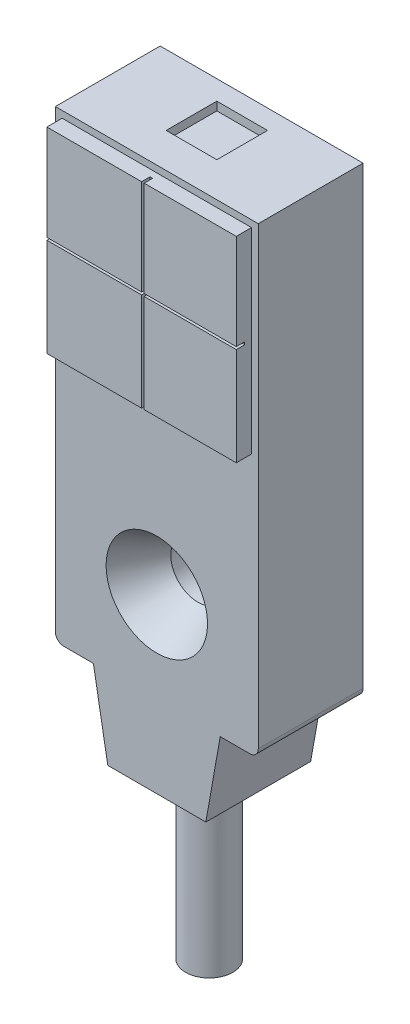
from build123d import *

# Parameters (mm, degrees)
EXTRUDE_1_DEPTH      = 6.2
SKETCH_2_W           = 11.2
SKETCH_2_H           = 11.6
EXTRUDE_2_DEPTH      = 0.9
CUT_EXTRUDE_2_DEPTH  = 0.5
CUT_EXTRUDE_3_DEPTH  = 0.5
SKETCH_6_R           = 1.6
CUT_EXTRUDE_4_DEPTH  = 6.2
SKETCH_12_R          = 2.133435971
EXTRUDE_3_DEPTH      = 6.2
SKETCH_13_R          = 1.6
CUT_EXTRUDE_6_DEPTH  = 2
SKETCH_17_R          = 1.6
CUT_EXTRUDE_12_DEPTH = 6.2
CHAMFER_4_SIZE       = 1.4
CHAMFER_4_SIZE2      = 2.424871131
SKETCH_18_R          = 1.4
EXTRUDE_5_DEPTH      = 10


with BuildPart() as part:
    # Sketch 1 → Extrude 1 (new body)
    with BuildSketch(Plane.XY):
        with BuildLine():
            Line((0, 0.5), (0, 27.4))
            Line((0, 27.4), (12, 27.4))
            Line((12, 27.4), (12, 0.5))
            ThreePointArc((12, 0.5), (11.853553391, 0.146446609), (11.5, 0))
            Line((11.5, 0), (9.75, 0))
            Line((9.75, 0), (8.9, -4.8))
            Line((8.9, -4.8), (6, -4.8))
            Line((6, -4.8), (3.1, -4.8))
            Line((3.1, -4.8), (2.25, 0))
            Line((2.25, 0), (0.5, 0))
            ThreePointArc((0.5, 0), (0.146446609, 0.146446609), (0, 0.5))
        make_face()
    extrude(amount=EXTRUDE_1_DEPTH)

    # Sketch 2 → Extrude 2 (add)
    with BuildSketch(Plane.XY.offset(6.2)):
        with Locations((6, 21.2)):
            Rectangle(SKETCH_2_W, SKETCH_2_H)
    extrude(amount=EXTRUDE_2_DEPTH)

    # Sketch 4 → Cut-Extrude 2 (cut)
    with BuildSketch(Plane.XY.offset(7.1)):
        Polygon((6, 27), (6, 21.35), (0.4, 21.35), (0.4, 21.2), (6, 21.2), (6, 15.4), (6.15, 15.4), (6.15, 21.2), (11.6, 21.2), (11.6, 21.35), (6.15, 21.35), (6.15, 27), align=None)
    extrude(amount=-CUT_EXTRUDE_2_DEPTH, mode=Mode.SUBTRACT)

    # Sketch 5 → Cut-Extrude 3 (cut)
    with BuildSketch(Plane(origin=(0, 27.4, 0), x_dir=(1, 0, 0), z_dir=(0, 1, 0))):
        Polygon((6, -1.15), (4.5, -1.15), (4.5, -4.15), (7.5, -4.15), (7.5, -1.15), align=None)
    extrude(amount=-CUT_EXTRUDE_3_DEPTH, mode=Mode.SUBTRACT)

    # Sketch 6 → Cut-Extrude 4 (cut)
    with BuildSketch(Plane.XY.offset(6.2)):
        with Locations((6, 5.4)):
            Circle(SKETCH_6_R)
    extrude(amount=-CUT_EXTRUDE_4_DEPTH, mode=Mode.SUBTRACT)

    # Sketch 12 → Extrude 3 (add)
    with BuildSketch(Plane.XY.offset(6.2)):
        with Locations((6, 5.4)):
            Circle(SKETCH_12_R)
    extrude(amount=-EXTRUDE_3_DEPTH)

    # Sketch 13 → Cut-Extrude 6 (cut)
    with BuildSketch(Plane.XY.offset(6.2)):
        with Locations((6, 5.4)):
            Circle(SKETCH_13_R)
    extrude(amount=-CUT_EXTRUDE_6_DEPTH, mode=Mode.SUBTRACT)

    # Sketch 17 → Cut-Extrude 12 (cut)
    with BuildSketch(Plane.XY.offset(6.2)):
        with Locations((6, 5.4)):
            Circle(SKETCH_17_R)
    extrude(amount=-CUT_EXTRUDE_12_DEPTH, mode=Mode.SUBTRACT)

    # Chamfer 4
    chamfer_4_edges = [part.edges().sort_by_distance(p)[0] for p in [
        (4.4, 5.4, 6.2),
    ]]
    chamfer_4_side = [part.faces().sort_by_distance(p)[0] for p in [
        (6, 7.336487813, 6.2),
    ]]
    chamfer(chamfer_4_edges, length=CHAMFER_4_SIZE, length2=CHAMFER_4_SIZE2, reference=chamfer_4_side[0])

    # Sketch 18 → Extrude 5 (add)
    with BuildSketch(Plane.XZ.offset(4.8)):
        with Locations(Location((6, 3.1, 0), (0, 0, 180))):
            Circle(SKETCH_18_R)
    extrude(amount=EXTRUDE_5_DEPTH)


solid = part.part
